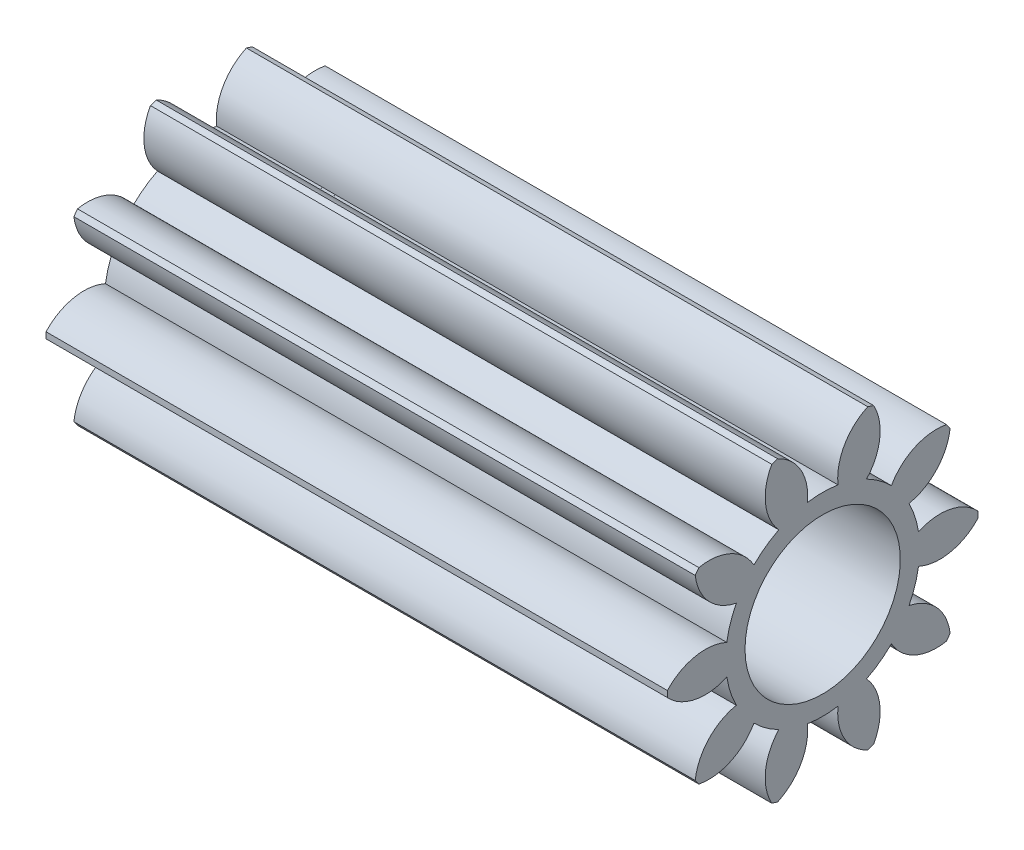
ISO-10303-21;
HEADER;
FILE_DESCRIPTION(('STEP AP214'),'2;1');
FILE_NAME('part.step','',(''),(''),'','','');
FILE_SCHEMA(('AUTOMOTIVE_DESIGN { 1 0 10303 214 1 1 1 1 }'));
ENDSEC;
DATA;
#1=APPLICATION_CONTEXT('core data for automotive mechanical design processes');
#2=APPLICATION_PROTOCOL_DEFINITION('international standard','automotive_design',2000,#1);
#3=PRODUCT_CONTEXT('',#1,'mechanical');
#4=PRODUCT('Part','Part','',(#3));
#5=PRODUCT_RELATED_PRODUCT_CATEGORY('part','',(#4));
#6=PRODUCT_DEFINITION_FORMATION('','',#4);
#7=PRODUCT_DEFINITION_CONTEXT('part definition',#1,'design');
#8=PRODUCT_DEFINITION('design','',#6,#7);
#9=PRODUCT_DEFINITION_SHAPE('','',#8);
#10=(LENGTH_UNIT() NAMED_UNIT(*) SI_UNIT(.MILLI.,.METRE.));
#11=(NAMED_UNIT(*) PLANE_ANGLE_UNIT() SI_UNIT($,.RADIAN.));
#12=(NAMED_UNIT(*) SI_UNIT($,.STERADIAN.) SOLID_ANGLE_UNIT());
#13=UNCERTAINTY_MEASURE_WITH_UNIT(LENGTH_MEASURE(1.E-05),#10,'distance_accuracy_value','');
#14=(GEOMETRIC_REPRESENTATION_CONTEXT(3) GLOBAL_UNCERTAINTY_ASSIGNED_CONTEXT((#13)) GLOBAL_UNIT_ASSIGNED_CONTEXT((#10,
#11,#12)) REPRESENTATION_CONTEXT('',''));
#15=CARTESIAN_POINT('',(0.,0.,0.));
#16=DIRECTION('',(0.,0.,1.));
#17=DIRECTION('',(1.,0.,0.));
#18=AXIS2_PLACEMENT_3D('',#15,#16,#17);
#19=CARTESIAN_POINT('',(12.,0.,0.));
#20=DIRECTION('',(-1.,0.,0.));
#21=DIRECTION('',(0.,0.,1.));
#22=AXIS2_PLACEMENT_3D('',#19,#20,#21);
#23=PLANE('',#22);
#24=CARTESIAN_POINT('',(12.,0.,0.));
#25=DIRECTION('',(-1.,0.,0.));
#26=DIRECTION('',(0.,0.,1.));
#27=AXIS2_PLACEMENT_3D('',#24,#25,#26);
#28=CIRCLE('',#27,1.5);
#29=CARTESIAN_POINT('',(12.,0.,1.5));
#30=VERTEX_POINT('',#29);
#31=EDGE_CURVE('E352',#30,#30,#28,.F.);
#32=ORIENTED_EDGE('',*,*,#31,.F.);
#33=EDGE_LOOP('',(#32));
#34=FACE_BOUND('',#33,.T.);
#35=CARTESIAN_POINT('',(12.,-0.620212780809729,-2.26588282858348));
#36=DIRECTION('',(-1.,0.,0.));
#37=DIRECTION('',(0.,-0.95105651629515,-0.309016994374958));
#38=AXIS2_PLACEMENT_3D('',#35,#36,#37);
#39=CIRCLE('',#38,1.);
#40=CARTESIAN_POINT('',(12.,0.289865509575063,-1.85144645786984));
#41=VERTEX_POINT('',#40);
#42=CARTESIAN_POINT('',(12.,0.0594463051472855,-2.99941096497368));
#43=VERTEX_POINT('',#42);
#44=EDGE_CURVE('E358',#41,#43,#39,.T.);
#45=ORIENTED_EDGE('',*,*,#44,.F.);
#46=CARTESIAN_POINT('',(12.,0.,0.));
#47=DIRECTION('',(-1.,0.,0.));
#48=DIRECTION('',(0.,-0.95105651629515,-0.309016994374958));
#49=AXIS2_PLACEMENT_3D('',#46,#47,#48);
#50=CIRCLE('',#49,1.874);
#51=CARTESIAN_POINT('',(12.,0.853746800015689,-1.66823032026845));
#52=VERTEX_POINT('',#51);
#53=EDGE_CURVE('E363',#52,#41,#50,.T.);
#54=ORIENTED_EDGE('',*,*,#53,.F.);
#55=CARTESIAN_POINT('',(12.,1.83361518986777,-1.46858578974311));
#56=DIRECTION('',(-1.,0.,0.));
#57=DIRECTION('',(0.,-0.95105651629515,-0.309016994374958));
#58=AXIS2_PLACEMENT_3D('',#55,#56,#57);
#59=CIRCLE('',#58,1.);
#60=CARTESIAN_POINT('',(12.,1.71491645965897,-2.46151610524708));
#61=VERTEX_POINT('',#60);
#62=EDGE_CURVE('E360',#61,#52,#59,.T.);
#63=ORIENTED_EDGE('',*,*,#62,.F.);
#64=CARTESIAN_POINT('',(12.,0.,0.));
#65=DIRECTION('',(-1.,0.,0.));
#66=DIRECTION('',(0.,0.,1.));
#67=AXIS2_PLACEMENT_3D('',#64,#65,#66);
#68=CIRCLE('',#67,3.);
#69=CARTESIAN_POINT('',(12.,1.81110260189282,-2.39163278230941));
#70=VERTEX_POINT('',#69);
#71=EDGE_CURVE('E524',#70,#61,#68,.T.);
#72=ORIENTED_EDGE('',*,*,#71,.F.);
#73=CARTESIAN_POINT('',(12.,0.830089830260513,-2.19768964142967));
#74=DIRECTION('',(-1.,0.,0.));
#75=DIRECTION('',(0.,-0.587785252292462,-0.809016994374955));
#76=AXIS2_PLACEMENT_3D('',#73,#74,#75);
#77=CIRCLE('',#76,1.);
#78=CARTESIAN_POINT('',(12.,1.32275904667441,-1.32747297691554));
#79=VERTEX_POINT('',#78);
#80=EDGE_CURVE('E343',#79,#70,#77,.T.);
#81=ORIENTED_EDGE('',*,*,#80,.F.);
#82=CARTESIAN_POINT('',(12.,0.,0.));
#83=DIRECTION('',(-1.,0.,0.));
#84=DIRECTION('',(0.,-0.587785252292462,-0.809016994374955));
#85=AXIS2_PLACEMENT_3D('',#82,#83,#84);
#86=CIRCLE('',#85,1.874);
#87=CARTESIAN_POINT('',(12.,1.67125684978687,-0.84780690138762));
#88=VERTEX_POINT('',#87);
#89=EDGE_CURVE('E348',#88,#79,#86,.T.);
#90=ORIENTED_EDGE('',*,*,#89,.F.);
#91=CARTESIAN_POINT('',(12.,2.34663891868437,-0.110338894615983));
#92=DIRECTION('',(-1.,0.,0.));
#93=DIRECTION('',(0.,-0.587785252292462,-0.809016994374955));
#94=AXIS2_PLACEMENT_3D('',#91,#92,#93);
#95=CIRCLE('',#94,1.);
#96=CARTESIAN_POINT('',(12.,2.83423942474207,-0.983405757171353));
#97=VERTEX_POINT('',#96);
#98=EDGE_CURVE('E345',#97,#88,#95,.T.);
#99=ORIENTED_EDGE('',*,*,#98,.F.);
#100=CARTESIAN_POINT('',(12.,2.87097926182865,-0.870332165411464));
#101=VERTEX_POINT('',#100);
#102=EDGE_CURVE('E520',#101,#97,#68,.T.);
#103=ORIENTED_EDGE('',*,*,#102,.F.);
#104=CARTESIAN_POINT('',(12.,1.96332633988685,-1.29005370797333));
#105=DIRECTION('',(-1.,0.,0.));
#106=DIRECTION('',(0.,0.,-1.));
#107=AXIS2_PLACEMENT_3D('',#104,#105,#106);
#108=CIRCLE('',#107,1.);
#109=CARTESIAN_POINT('',(12.,1.85040358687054,-0.296449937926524));
#110=VERTEX_POINT('',#109);
#111=EDGE_CURVE('E492',#110,#101,#108,.T.);
#112=ORIENTED_EDGE('',*,*,#111,.F.);
#113=CARTESIAN_POINT('',(12.,0.,0.));
#114=DIRECTION('',(-1.,0.,0.));
#115=DIRECTION('',(0.,0.,-1.));
#116=AXIS2_PLACEMENT_3D('',#113,#114,#115);
#117=CIRCLE('',#116,1.874);
#118=CARTESIAN_POINT('',(12.,1.85040358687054,0.296449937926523));
#119=VERTEX_POINT('',#118);
#120=EDGE_CURVE('E497',#119,#110,#117,.T.);
#121=ORIENTED_EDGE('',*,*,#120,.F.);
#122=CARTESIAN_POINT('',(12.,1.96332633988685,1.29005370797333));
#123=DIRECTION('',(-1.,0.,0.));
#124=DIRECTION('',(0.,0.,-1.));
#125=AXIS2_PLACEMENT_3D('',#122,#123,#124);
#126=CIRCLE('',#125,1.);
#127=CARTESIAN_POINT('',(12.,2.87097926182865,0.870332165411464));
#128=VERTEX_POINT('',#127);
#129=EDGE_CURVE('E494',#128,#119,#126,.T.);
#130=ORIENTED_EDGE('',*,*,#129,.F.);
#131=CARTESIAN_POINT('',(12.,2.83423942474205,0.983405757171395));
#132=VERTEX_POINT('',#131);
#133=EDGE_CURVE('E517',#132,#128,#68,.T.);
#134=ORIENTED_EDGE('',*,*,#133,.F.);
#135=CARTESIAN_POINT('',(12.,2.34663891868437,0.110338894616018));
#136=DIRECTION('',(-1.,0.,0.));
#137=DIRECTION('',(0.,0.587785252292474,-0.809016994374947));
#138=AXIS2_PLACEMENT_3D('',#135,#136,#137);
#139=CIRCLE('',#138,1.);
#140=CARTESIAN_POINT('',(12.,1.67125684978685,0.847806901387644));
#141=VERTEX_POINT('',#140);
#142=EDGE_CURVE('E470',#141,#132,#139,.T.);
#143=ORIENTED_EDGE('',*,*,#142,.F.);
#144=CARTESIAN_POINT('',(12.,0.,0.));
#145=DIRECTION('',(-1.,0.,0.));
#146=DIRECTION('',(0.,0.587785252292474,-0.809016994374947));
#147=AXIS2_PLACEMENT_3D('',#144,#145,#146);
#148=CIRCLE('',#147,1.874);
#149=CARTESIAN_POINT('',(12.,1.32275904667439,1.32747297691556));
#150=VERTEX_POINT('',#149);
#151=EDGE_CURVE('E475',#150,#141,#148,.T.);
#152=ORIENTED_EDGE('',*,*,#151,.F.);
#153=CARTESIAN_POINT('',(12.,0.830089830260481,2.19768964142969));
#154=DIRECTION('',(-1.,0.,0.));
#155=DIRECTION('',(0.,0.587785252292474,-0.809016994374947));
#156=AXIS2_PLACEMENT_3D('',#153,#154,#155);
#157=CIRCLE('',#156,1.);
#158=CARTESIAN_POINT('',(12.,1.81110260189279,2.39163278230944));
#159=VERTEX_POINT('',#158);
#160=EDGE_CURVE('E472',#159,#150,#157,.T.);
#161=ORIENTED_EDGE('',*,*,#160,.F.);
#162=CARTESIAN_POINT('',(12.,1.71491645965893,2.4615161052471));
#163=VERTEX_POINT('',#162);
#164=EDGE_CURVE('E525',#163,#159,#68,.T.);
#165=ORIENTED_EDGE('',*,*,#164,.F.);
#166=CARTESIAN_POINT('',(12.,1.83361518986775,1.46858578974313));
#167=DIRECTION('',(-1.,0.,0.));
#168=DIRECTION('',(0.,0.951056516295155,-0.309016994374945));
#169=AXIS2_PLACEMENT_3D('',#166,#167,#168);
#170=CIRCLE('',#169,1.);
#171=CARTESIAN_POINT('',(12.,0.853746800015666,1.66823032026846));
#172=VERTEX_POINT('',#171);
#173=EDGE_CURVE('E405',#172,#163,#170,.T.);
#174=ORIENTED_EDGE('',*,*,#173,.F.);
#175=CARTESIAN_POINT('',(12.,0.,0.));
#176=DIRECTION('',(-1.,0.,0.));
#177=DIRECTION('',(0.,0.951056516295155,-0.309016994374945));
#178=AXIS2_PLACEMENT_3D('',#175,#176,#177);
#179=CIRCLE('',#178,1.874);
#180=CARTESIAN_POINT('',(12.,0.289865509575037,1.85144645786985));
#181=VERTEX_POINT('',#180);
#182=EDGE_CURVE('E410',#181,#172,#179,.T.);
#183=ORIENTED_EDGE('',*,*,#182,.F.);
#184=CARTESIAN_POINT('',(12.,-0.620212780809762,2.26588282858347));
#185=DIRECTION('',(-1.,0.,0.));
#186=DIRECTION('',(0.,0.951056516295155,-0.309016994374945));
#187=AXIS2_PLACEMENT_3D('',#184,#185,#186);
#188=CIRCLE('',#187,1.);
#189=CARTESIAN_POINT('',(12.,0.0594463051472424,2.99941096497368));
#190=VERTEX_POINT('',#189);
#191=EDGE_CURVE('E407',#190,#181,#188,.T.);
#192=ORIENTED_EDGE('',*,*,#191,.F.);
#193=CARTESIAN_POINT('',(12.,-0.0594463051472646,2.99941096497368));
#194=VERTEX_POINT('',#193);
#195=EDGE_CURVE('E688',#194,#190,#68,.T.);
#196=ORIENTED_EDGE('',*,*,#195,.F.);
#197=CARTESIAN_POINT('',(12.,0.620212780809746,2.26588282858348));
#198=DIRECTION('',(-1.,0.,0.));
#199=DIRECTION('',(0.,0.951056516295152,0.309016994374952));
#200=AXIS2_PLACEMENT_3D('',#197,#198,#199);
#201=CIRCLE('',#200,1.);
#202=CARTESIAN_POINT('',(12.,-0.28986550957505,1.85144645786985));
#203=VERTEX_POINT('',#202);
#204=EDGE_CURVE('E424',#203,#194,#201,.T.);
#205=ORIENTED_EDGE('',*,*,#204,.F.);
#206=CARTESIAN_POINT('',(12.,0.,0.));
#207=DIRECTION('',(-1.,0.,0.));
#208=DIRECTION('',(0.,0.951056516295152,0.309016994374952));
#209=AXIS2_PLACEMENT_3D('',#206,#207,#208);
#210=CIRCLE('',#209,1.874);
#211=CARTESIAN_POINT('',(12.,-0.853746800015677,1.66823032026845));
#212=VERTEX_POINT('',#211);
#213=EDGE_CURVE('E429',#212,#203,#210,.T.);
#214=ORIENTED_EDGE('',*,*,#213,.F.);
#215=CARTESIAN_POINT('',(12.,-1.83361518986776,1.46858578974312));
#216=DIRECTION('',(-1.,0.,0.));
#217=DIRECTION('',(0.,0.951056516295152,0.309016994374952));
#218=AXIS2_PLACEMENT_3D('',#215,#216,#217);
#219=CIRCLE('',#218,1.);
#220=CARTESIAN_POINT('',(12.,-1.71491645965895,2.46151610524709));
#221=VERTEX_POINT('',#220);
#222=EDGE_CURVE('E426',#221,#212,#219,.T.);
#223=ORIENTED_EDGE('',*,*,#222,.F.);
#224=CARTESIAN_POINT('',(12.,-1.8111026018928,2.39163278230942));
#225=VERTEX_POINT('',#224);
#226=EDGE_CURVE('E669',#225,#221,#68,.T.);
#227=ORIENTED_EDGE('',*,*,#226,.F.);
#228=CARTESIAN_POINT('',(12.,-0.830089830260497,2.19768964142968));
#229=DIRECTION('',(-1.,0.,0.));
#230=DIRECTION('',(0.,0.587785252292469,0.809016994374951));
#231=AXIS2_PLACEMENT_3D('',#228,#229,#230);
#232=CIRCLE('',#231,1.);
#233=CARTESIAN_POINT('',(12.,-1.3227590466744,1.32747297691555));
#234=VERTEX_POINT('',#233);
#235=EDGE_CURVE('E388',#234,#225,#232,.T.);
#236=ORIENTED_EDGE('',*,*,#235,.F.);
#237=CARTESIAN_POINT('',(12.,0.,0.));
#238=DIRECTION('',(-1.,0.,0.));
#239=DIRECTION('',(0.,0.587785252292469,0.809016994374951));
#240=AXIS2_PLACEMENT_3D('',#237,#238,#239);
#241=CIRCLE('',#240,1.874);
#242=CARTESIAN_POINT('',(12.,-1.67125684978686,0.847806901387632));
#243=VERTEX_POINT('',#242);
#244=EDGE_CURVE('E393',#243,#234,#241,.T.);
#245=ORIENTED_EDGE('',*,*,#244,.F.);
#246=CARTESIAN_POINT('',(12.,-2.34663891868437,0.110338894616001));
#247=DIRECTION('',(-1.,0.,0.));
#248=DIRECTION('',(0.,0.587785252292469,0.809016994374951));
#249=AXIS2_PLACEMENT_3D('',#246,#247,#248);
#250=CIRCLE('',#249,1.);
#251=CARTESIAN_POINT('',(12.,-2.83423942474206,0.983405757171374));
#252=VERTEX_POINT('',#251);
#253=EDGE_CURVE('E390',#252,#243,#250,.T.);
#254=ORIENTED_EDGE('',*,*,#253,.F.);
#255=CARTESIAN_POINT('',(12.,-2.87097926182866,0.870332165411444));
#256=VERTEX_POINT('',#255);
#257=EDGE_CURVE('E650',#256,#252,#68,.T.);
#258=ORIENTED_EDGE('',*,*,#257,.F.);
#259=CARTESIAN_POINT('',(12.,-1.96332633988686,1.29005370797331));
#260=DIRECTION('',(-1.,0.,0.));
#261=DIRECTION('',(0.,0.,1.));
#262=AXIS2_PLACEMENT_3D('',#259,#260,#261);
#263=CIRCLE('',#262,1.);
#264=CARTESIAN_POINT('',(12.,-1.85040358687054,0.296449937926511));
#265=VERTEX_POINT('',#264);
#266=EDGE_CURVE('E371',#265,#256,#263,.T.);
#267=ORIENTED_EDGE('',*,*,#266,.F.);
#268=CARTESIAN_POINT('',(12.,0.,0.));
#269=DIRECTION('',(-1.,0.,0.));
#270=DIRECTION('',(0.,0.,1.));
#271=AXIS2_PLACEMENT_3D('',#268,#269,#270);
#272=CIRCLE('',#271,1.874);
#273=CARTESIAN_POINT('',(12.,-1.85040358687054,-0.296449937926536));
#274=VERTEX_POINT('',#273);
#275=EDGE_CURVE('E376',#274,#265,#272,.T.);
#276=ORIENTED_EDGE('',*,*,#275,.F.);
#277=CARTESIAN_POINT('',(12.,-1.96332633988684,-1.29005370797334));
#278=DIRECTION('',(-1.,0.,0.));
#279=DIRECTION('',(0.,0.,1.));
#280=AXIS2_PLACEMENT_3D('',#277,#278,#279);
#281=CIRCLE('',#280,1.);
#282=CARTESIAN_POINT('',(12.,-2.87097926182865,-0.870332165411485));
#283=VERTEX_POINT('',#282);
#284=EDGE_CURVE('E373',#283,#274,#281,.T.);
#285=ORIENTED_EDGE('',*,*,#284,.F.);
#286=CARTESIAN_POINT('',(12.,-2.83423942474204,-0.983405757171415));
#287=VERTEX_POINT('',#286);
#288=EDGE_CURVE('E631',#287,#283,#68,.T.);
#289=ORIENTED_EDGE('',*,*,#288,.F.);
#290=CARTESIAN_POINT('',(12.,-2.34663891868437,-0.110338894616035));
#291=DIRECTION('',(-1.,0.,0.));
#292=DIRECTION('',(0.,-0.58778525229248,0.809016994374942));
#293=AXIS2_PLACEMENT_3D('',#290,#291,#292);
#294=CIRCLE('',#293,1.);
#295=CARTESIAN_POINT('',(12.,-1.67125684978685,-0.847806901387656));
#296=VERTEX_POINT('',#295);
#297=EDGE_CURVE('E326',#296,#287,#294,.T.);
#298=ORIENTED_EDGE('',*,*,#297,.F.);
#299=CARTESIAN_POINT('',(12.,0.,0.));
#300=DIRECTION('',(-1.,0.,0.));
#301=DIRECTION('',(0.,-0.58778525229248,0.809016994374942));
#302=AXIS2_PLACEMENT_3D('',#299,#300,#301);
#303=CIRCLE('',#302,1.874);
#304=CARTESIAN_POINT('',(12.,-1.32275904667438,-1.32747297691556));
#305=VERTEX_POINT('',#304);
#306=EDGE_CURVE('E331',#305,#296,#303,.T.);
#307=ORIENTED_EDGE('',*,*,#306,.F.);
#308=CARTESIAN_POINT('',(12.,-0.830089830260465,-2.19768964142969));
#309=DIRECTION('',(-1.,0.,0.));
#310=DIRECTION('',(0.,-0.58778525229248,0.809016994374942));
#311=AXIS2_PLACEMENT_3D('',#308,#309,#310);
#312=CIRCLE('',#311,1.);
#313=CARTESIAN_POINT('',(12.,-1.81110260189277,-2.39163278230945));
#314=VERTEX_POINT('',#313);
#315=EDGE_CURVE('E328',#314,#305,#312,.T.);
#316=ORIENTED_EDGE('',*,*,#315,.F.);
#317=CARTESIAN_POINT('',(12.,-1.71491645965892,-2.46151610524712));
#318=VERTEX_POINT('',#317);
#319=EDGE_CURVE('E612',#318,#314,#68,.T.);
#320=ORIENTED_EDGE('',*,*,#319,.F.);
#321=CARTESIAN_POINT('',(12.,-1.83361518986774,-1.46858578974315));
#322=DIRECTION('',(-1.,0.,0.));
#323=DIRECTION('',(0.,-0.951056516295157,0.309016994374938));
#324=AXIS2_PLACEMENT_3D('',#321,#322,#323);
#325=CIRCLE('',#324,1.);
#326=CARTESIAN_POINT('',(12.,-0.853746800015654,-1.66823032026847));
#327=VERTEX_POINT('',#326);
#328=EDGE_CURVE('E302',#327,#318,#325,.T.);
#329=ORIENTED_EDGE('',*,*,#328,.F.);
#330=CARTESIAN_POINT('',(12.,0.,0.));
#331=DIRECTION('',(-1.,0.,0.));
#332=DIRECTION('',(0.,-0.951056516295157,0.309016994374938));
#333=AXIS2_PLACEMENT_3D('',#330,#331,#332);
#334=CIRCLE('',#333,1.874);
#335=CARTESIAN_POINT('',(12.,-0.289865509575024,-1.85144645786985));
#336=VERTEX_POINT('',#335);
#337=EDGE_CURVE('E301',#336,#327,#334,.T.);
#338=ORIENTED_EDGE('',*,*,#337,.F.);
#339=CARTESIAN_POINT('',(12.,0.620212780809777,-2.26588282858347));
#340=DIRECTION('',(-1.,0.,0.));
#341=DIRECTION('',(0.,-0.951056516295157,0.309016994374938));
#342=AXIS2_PLACEMENT_3D('',#339,#340,#341);
#343=CIRCLE('',#342,1.);
#344=CARTESIAN_POINT('',(12.,-0.0594463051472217,-2.99941096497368));
#345=VERTEX_POINT('',#344);
#346=EDGE_CURVE('E290',#345,#336,#343,.T.);
#347=ORIENTED_EDGE('',*,*,#346,.F.);
#348=EDGE_CURVE('E748',#43,#345,#68,.T.);
#349=ORIENTED_EDGE('',*,*,#348,.F.);
#350=EDGE_LOOP('',(#45,#54,#63,#72,#81,#90,#99,#103,#112,#121,#130,#134,#143,#152,#161,#165,
#174,#183,#192,#196,#205,#214,#223,#227,#236,#245,#254,#258,#267,#276,#285,#289,#298,#307,#316,
#320,#329,#338,#347,#349));
#351=FACE_BOUND('',#350,.T.);
#352=ADVANCED_FACE('F33',(#34,#351),#23,.F.);
#353=CARTESIAN_POINT('',(-10.,0.,0.));
#354=DIRECTION('',(-1.,0.,0.));
#355=DIRECTION('',(0.,0.,1.));
#356=AXIS2_PLACEMENT_3D('',#353,#354,#355);
#357=CYLINDRICAL_SURFACE('',#356,3.);
#358=DIRECTION('',(-1.,0.,0.));
#359=VECTOR('',#358,1.);
#360=CARTESIAN_POINT('',(6.,0.0594463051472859,-2.99941096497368));
#361=LINE('',#360,#359);
#362=CARTESIAN_POINT('',(0.,0.0594463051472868,-2.99941096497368));
#363=VERTEX_POINT('',#362);
#364=EDGE_CURVE('E467',#43,#363,#361,.T.);
#365=ORIENTED_EDGE('',*,*,#364,.F.);
#366=ORIENTED_EDGE('',*,*,#348,.T.);
#367=DIRECTION('',(-1.,0.,0.));
#368=VECTOR('',#367,1.);
#369=CARTESIAN_POINT('',(6.,-0.0594463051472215,-2.99941096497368));
#370=LINE('',#369,#368);
#371=CARTESIAN_POINT('',(0.,-0.0594463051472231,-2.99941096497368));
#372=VERTEX_POINT('',#371);
#373=EDGE_CURVE('E296',#372,#345,#370,.F.);
#374=ORIENTED_EDGE('',*,*,#373,.F.);
#375=CARTESIAN_POINT('',(0.,0.,0.));
#376=DIRECTION('',(-1.,0.,0.));
#377=DIRECTION('',(0.,0.,1.));
#378=AXIS2_PLACEMENT_3D('',#375,#376,#377);
#379=CIRCLE('',#378,3.);
#380=EDGE_CURVE('E582',#363,#372,#379,.T.);
#381=ORIENTED_EDGE('',*,*,#380,.F.);
#382=EDGE_LOOP('',(#365,#366,#374,#381));
#383=FACE_BOUND('',#382,.T.);
#384=ADVANCED_FACE('F733',(#383),#357,.T.);
#385=DIRECTION('',(-1.,0.,0.));
#386=VECTOR('',#385,1.);
#387=CARTESIAN_POINT('',(6.,1.71491645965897,-2.46151610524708));
#388=LINE('',#387,#386);
#389=CARTESIAN_POINT('',(0.,1.71491645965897,-2.46151610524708));
#390=VERTEX_POINT('',#389);
#391=EDGE_CURVE('E465',#390,#61,#388,.F.);
#392=ORIENTED_EDGE('',*,*,#391,.F.);
#393=CARTESIAN_POINT('',(0.,1.81110260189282,-2.39163278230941));
#394=VERTEX_POINT('',#393);
#395=EDGE_CURVE('E518',#394,#390,#379,.T.);
#396=ORIENTED_EDGE('',*,*,#395,.F.);
#397=DIRECTION('',(-1.,0.,0.));
#398=VECTOR('',#397,1.);
#399=CARTESIAN_POINT('',(6.,1.81110260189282,-2.39163278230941));
#400=LINE('',#399,#398);
#401=EDGE_CURVE('E463',#70,#394,#400,.T.);
#402=ORIENTED_EDGE('',*,*,#401,.F.);
#403=ORIENTED_EDGE('',*,*,#71,.T.);
#404=EDGE_LOOP('',(#392,#396,#402,#403));
#405=FACE_BOUND('',#404,.T.);
#406=ADVANCED_FACE('F579',(#405),#357,.T.);
#407=DIRECTION('',(-1.,0.,0.));
#408=VECTOR('',#407,1.);
#409=CARTESIAN_POINT('',(6.,2.83423942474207,-0.983405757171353));
#410=LINE('',#409,#408);
#411=CARTESIAN_POINT('',(0.,2.83423942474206,-0.983405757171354));
#412=VERTEX_POINT('',#411);
#413=EDGE_CURVE('E461',#412,#97,#410,.F.);
#414=ORIENTED_EDGE('',*,*,#413,.F.);
#415=CARTESIAN_POINT('',(0.,2.87097926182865,-0.870332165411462));
#416=VERTEX_POINT('',#415);
#417=EDGE_CURVE('E514',#416,#412,#379,.T.);
#418=ORIENTED_EDGE('',*,*,#417,.F.);
#419=DIRECTION('',(-1.,0.,0.));
#420=VECTOR('',#419,1.);
#421=CARTESIAN_POINT('',(6.,2.87097926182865,-0.870332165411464));
#422=LINE('',#421,#420);
#423=EDGE_CURVE('E511',#101,#416,#422,.T.);
#424=ORIENTED_EDGE('',*,*,#423,.F.);
#425=ORIENTED_EDGE('',*,*,#102,.T.);
#426=EDGE_LOOP('',(#414,#418,#424,#425));
#427=FACE_BOUND('',#426,.T.);
#428=ADVANCED_FACE('F553',(#427),#357,.T.);
#429=DIRECTION('',(-1.,0.,0.));
#430=VECTOR('',#429,1.);
#431=CARTESIAN_POINT('',(6.,-2.83423942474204,-0.983405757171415));
#432=LINE('',#431,#430);
#433=CARTESIAN_POINT('',(0.,-2.83423942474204,-0.983405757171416));
#434=VERTEX_POINT('',#433);
#435=EDGE_CURVE('E459',#287,#434,#432,.T.);
#436=ORIENTED_EDGE('',*,*,#435,.F.);
#437=ORIENTED_EDGE('',*,*,#288,.T.);
#438=DIRECTION('',(-1.,0.,0.));
#439=VECTOR('',#438,1.);
#440=CARTESIAN_POINT('',(6.,-2.87097926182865,-0.870332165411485));
#441=LINE('',#440,#439);
#442=CARTESIAN_POINT('',(0.,-2.87097926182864,-0.870332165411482));
#443=VERTEX_POINT('',#442);
#444=EDGE_CURVE('E442',#443,#283,#441,.F.);
#445=ORIENTED_EDGE('',*,*,#444,.F.);
#446=EDGE_CURVE('E598',#434,#443,#379,.T.);
#447=ORIENTED_EDGE('',*,*,#446,.F.);
#448=EDGE_LOOP('',(#436,#437,#445,#447));
#449=FACE_BOUND('',#448,.T.);
#450=ADVANCED_FACE('F629',(#449),#357,.T.);
#451=DIRECTION('',(-1.,0.,0.));
#452=VECTOR('',#451,1.);
#453=CARTESIAN_POINT('',(6.,-1.81110260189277,-2.39163278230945));
#454=LINE('',#453,#452);
#455=CARTESIAN_POINT('',(0.,-1.81110260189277,-2.39163278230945));
#456=VERTEX_POINT('',#455);
#457=EDGE_CURVE('E457',#456,#314,#454,.F.);
#458=ORIENTED_EDGE('',*,*,#457,.F.);
#459=CARTESIAN_POINT('',(0.,-1.71491645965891,-2.46151610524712));
#460=VERTEX_POINT('',#459);
#461=EDGE_CURVE('E584',#460,#456,#379,.T.);
#462=ORIENTED_EDGE('',*,*,#461,.F.);
#463=DIRECTION('',(-1.,0.,0.));
#464=VECTOR('',#463,1.);
#465=CARTESIAN_POINT('',(6.,-1.71491645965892,-2.46151610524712));
#466=LINE('',#465,#464);
#467=EDGE_CURVE('E455',#318,#460,#466,.T.);
#468=ORIENTED_EDGE('',*,*,#467,.F.);
#469=ORIENTED_EDGE('',*,*,#319,.T.);
#470=EDGE_LOOP('',(#458,#462,#468,#469));
#471=FACE_BOUND('',#470,.T.);
#472=ADVANCED_FACE('F610',(#471),#357,.T.);
#473=DIRECTION('',(-1.,0.,0.));
#474=VECTOR('',#473,1.);
#475=CARTESIAN_POINT('',(6.,1.71491645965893,2.4615161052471));
#476=LINE('',#475,#474);
#477=CARTESIAN_POINT('',(0.,1.71491645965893,2.4615161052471));
#478=VERTEX_POINT('',#477);
#479=EDGE_CURVE('E452',#163,#478,#476,.T.);
#480=ORIENTED_EDGE('',*,*,#479,.F.);
#481=ORIENTED_EDGE('',*,*,#164,.T.);
#482=DIRECTION('',(-1.,0.,0.));
#483=VECTOR('',#482,1.);
#484=CARTESIAN_POINT('',(6.,1.81110260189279,2.39163278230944));
#485=LINE('',#484,#483);
#486=CARTESIAN_POINT('',(0.,1.81110260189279,2.39163278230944));
#487=VERTEX_POINT('',#486);
#488=EDGE_CURVE('E486',#487,#159,#485,.F.);
#489=ORIENTED_EDGE('',*,*,#488,.F.);
#490=EDGE_CURVE('E519',#478,#487,#379,.T.);
#491=ORIENTED_EDGE('',*,*,#490,.F.);
#492=EDGE_LOOP('',(#480,#481,#489,#491));
#493=FACE_BOUND('',#492,.T.);
#494=ADVANCED_FACE('F705',(#493),#357,.T.);
#495=DIRECTION('',(-1.,0.,0.));
#496=VECTOR('',#495,1.);
#497=CARTESIAN_POINT('',(6.,0.0594463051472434,2.99941096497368));
#498=LINE('',#497,#496);
#499=CARTESIAN_POINT('',(0.,0.0594463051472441,2.99941096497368));
#500=VERTEX_POINT('',#499);
#501=EDGE_CURVE('E450',#500,#190,#498,.F.);
#502=ORIENTED_EDGE('',*,*,#501,.F.);
#503=CARTESIAN_POINT('',(0.,-0.0594463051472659,2.99941096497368));
#504=VERTEX_POINT('',#503);
#505=EDGE_CURVE('E586',#504,#500,#379,.T.);
#506=ORIENTED_EDGE('',*,*,#505,.F.);
#507=DIRECTION('',(-1.,0.,0.));
#508=VECTOR('',#507,1.);
#509=CARTESIAN_POINT('',(6.,-0.0594463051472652,2.99941096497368));
#510=LINE('',#509,#508);
#511=EDGE_CURVE('E448',#194,#504,#510,.T.);
#512=ORIENTED_EDGE('',*,*,#511,.F.);
#513=ORIENTED_EDGE('',*,*,#195,.T.);
#514=EDGE_LOOP('',(#502,#506,#512,#513));
#515=FACE_BOUND('',#514,.T.);
#516=ADVANCED_FACE('F686',(#515),#357,.T.);
#517=DIRECTION('',(-1.,0.,0.));
#518=VECTOR('',#517,1.);
#519=CARTESIAN_POINT('',(6.,-1.71491645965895,2.46151610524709));
#520=LINE('',#519,#518);
#521=CARTESIAN_POINT('',(0.,-1.71491645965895,2.46151610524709));
#522=VERTEX_POINT('',#521);
#523=EDGE_CURVE('E446',#522,#221,#520,.F.);
#524=ORIENTED_EDGE('',*,*,#523,.F.);
#525=CARTESIAN_POINT('',(0.,-1.8111026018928,2.39163278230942));
#526=VERTEX_POINT('',#525);
#527=EDGE_CURVE('E590',#526,#522,#379,.T.);
#528=ORIENTED_EDGE('',*,*,#527,.F.);
#529=DIRECTION('',(-1.,0.,0.));
#530=VECTOR('',#529,1.);
#531=CARTESIAN_POINT('',(6.,-1.8111026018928,2.39163278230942));
#532=LINE('',#531,#530);
#533=EDGE_CURVE('E440',#225,#526,#532,.T.);
#534=ORIENTED_EDGE('',*,*,#533,.F.);
#535=ORIENTED_EDGE('',*,*,#226,.T.);
#536=EDGE_LOOP('',(#524,#528,#534,#535));
#537=FACE_BOUND('',#536,.T.);
#538=ADVANCED_FACE('F667',(#537),#357,.T.);
#539=DIRECTION('',(-1.,0.,0.));
#540=VECTOR('',#539,1.);
#541=CARTESIAN_POINT('',(6.,-2.87097926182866,0.870332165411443));
#542=LINE('',#541,#540);
#543=CARTESIAN_POINT('',(0.,-2.87097926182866,0.870332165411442));
#544=VERTEX_POINT('',#543);
#545=EDGE_CURVE('E444',#256,#544,#542,.T.);
#546=ORIENTED_EDGE('',*,*,#545,.F.);
#547=ORIENTED_EDGE('',*,*,#257,.T.);
#548=DIRECTION('',(-1.,0.,0.));
#549=VECTOR('',#548,1.);
#550=CARTESIAN_POINT('',(6.,-2.83423942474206,0.983405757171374));
#551=LINE('',#550,#549);
#552=CARTESIAN_POINT('',(0.,-2.83423942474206,0.983405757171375));
#553=VERTEX_POINT('',#552);
#554=EDGE_CURVE('E423',#553,#252,#551,.F.);
#555=ORIENTED_EDGE('',*,*,#554,.F.);
#556=EDGE_CURVE('E594',#544,#553,#379,.T.);
#557=ORIENTED_EDGE('',*,*,#556,.F.);
#558=EDGE_LOOP('',(#546,#547,#555,#557));
#559=FACE_BOUND('',#558,.T.);
#560=ADVANCED_FACE('F648',(#559),#357,.T.);
#561=CARTESIAN_POINT('',(0.,0.,0.));
#562=DIRECTION('',(1.,0.,0.));
#563=DIRECTION('',(0.,0.,-1.));
#564=AXIS2_PLACEMENT_3D('',#561,#562,#563);
#565=PLANE('',#564);
#566=CARTESIAN_POINT('',(0.,0.,0.));
#567=DIRECTION('',(1.,0.,0.));
#568=DIRECTION('',(0.,0.,-1.));
#569=AXIS2_PLACEMENT_3D('',#566,#567,#568);
#570=CIRCLE('',#569,1.5);
#571=CARTESIAN_POINT('',(0.,0.,-1.5));
#572=VERTEX_POINT('',#571);
#573=EDGE_CURVE('E36',#572,#572,#570,.F.);
#574=ORIENTED_EDGE('',*,*,#573,.F.);
#575=EDGE_LOOP('',(#574));
#576=FACE_BOUND('',#575,.T.);
#577=CARTESIAN_POINT('',(0.,-0.620212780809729,-2.26588282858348));
#578=DIRECTION('',(-1.,0.,0.));
#579=DIRECTION('',(0.,-0.95105651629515,-0.309016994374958));
#580=AXIS2_PLACEMENT_3D('',#577,#578,#579);
#581=CIRCLE('',#580,1.);
#582=CARTESIAN_POINT('',(0.,0.289865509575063,-1.85144645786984));
#583=VERTEX_POINT('',#582);
#584=EDGE_CURVE('E48',#583,#363,#581,.T.);
#585=ORIENTED_EDGE('',*,*,#584,.T.);
#586=ORIENTED_EDGE('',*,*,#380,.T.);
#587=CARTESIAN_POINT('',(0.,0.620212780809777,-2.26588282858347));
#588=DIRECTION('',(1.,0.,0.));
#589=DIRECTION('',(0.,0.,-1.));
#590=AXIS2_PLACEMENT_3D('',#587,#588,#589);
#591=CIRCLE('',#590,1.);
#592=CARTESIAN_POINT('',(0.,-0.289865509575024,-1.85144645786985));
#593=VERTEX_POINT('',#592);
#594=EDGE_CURVE('E539',#593,#372,#591,.T.);
#595=ORIENTED_EDGE('',*,*,#594,.F.);
#596=CARTESIAN_POINT('',(0.,0.,0.));
#597=DIRECTION('',(-1.,0.,0.));
#598=DIRECTION('',(0.,-0.951056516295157,0.309016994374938));
#599=AXIS2_PLACEMENT_3D('',#596,#597,#598);
#600=CIRCLE('',#599,1.874);
#601=CARTESIAN_POINT('',(0.,-0.853746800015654,-1.66823032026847));
#602=VERTEX_POINT('',#601);
#603=EDGE_CURVE('E309',#593,#602,#600,.T.);
#604=ORIENTED_EDGE('',*,*,#603,.T.);
#605=CARTESIAN_POINT('',(0.,-1.83361518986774,-1.46858578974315));
#606=DIRECTION('',(-1.,0.,0.));
#607=DIRECTION('',(0.,-0.951056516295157,0.309016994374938));
#608=AXIS2_PLACEMENT_3D('',#605,#606,#607);
#609=CIRCLE('',#608,1.);
#610=EDGE_CURVE('E321',#602,#460,#609,.T.);
#611=ORIENTED_EDGE('',*,*,#610,.T.);
#612=ORIENTED_EDGE('',*,*,#461,.T.);
#613=CARTESIAN_POINT('',(0.,-0.830089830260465,-2.19768964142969));
#614=DIRECTION('',(1.,0.,0.));
#615=DIRECTION('',(0.,0.,-1.));
#616=AXIS2_PLACEMENT_3D('',#613,#614,#615);
#617=CIRCLE('',#616,1.);
#618=CARTESIAN_POINT('',(0.,-1.32275904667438,-1.32747297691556));
#619=VERTEX_POINT('',#618);
#620=EDGE_CURVE('E541',#619,#456,#617,.T.);
#621=ORIENTED_EDGE('',*,*,#620,.F.);
#622=CARTESIAN_POINT('',(0.,0.,0.));
#623=DIRECTION('',(-1.,0.,0.));
#624=DIRECTION('',(0.,-0.58778525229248,0.809016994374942));
#625=AXIS2_PLACEMENT_3D('',#622,#623,#624);
#626=CIRCLE('',#625,1.874);
#627=CARTESIAN_POINT('',(0.,-1.67125684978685,-0.847806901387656));
#628=VERTEX_POINT('',#627);
#629=EDGE_CURVE('E329',#619,#628,#626,.T.);
#630=ORIENTED_EDGE('',*,*,#629,.T.);
#631=CARTESIAN_POINT('',(0.,-2.34663891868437,-0.110338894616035));
#632=DIRECTION('',(-1.,0.,0.));
#633=DIRECTION('',(0.,-0.58778525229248,0.809016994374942));
#634=AXIS2_PLACEMENT_3D('',#631,#632,#633);
#635=CIRCLE('',#634,1.);
#636=EDGE_CURVE('E311',#628,#434,#635,.T.);
#637=ORIENTED_EDGE('',*,*,#636,.T.);
#638=ORIENTED_EDGE('',*,*,#446,.T.);
#639=CARTESIAN_POINT('',(0.,-1.96332633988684,-1.29005370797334));
#640=DIRECTION('',(1.,0.,0.));
#641=DIRECTION('',(0.,0.,-1.));
#642=AXIS2_PLACEMENT_3D('',#639,#640,#641);
#643=CIRCLE('',#642,1.);
#644=CARTESIAN_POINT('',(0.,-1.85040358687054,-0.296449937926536));
#645=VERTEX_POINT('',#644);
#646=EDGE_CURVE('E533',#645,#443,#643,.T.);
#647=ORIENTED_EDGE('',*,*,#646,.F.);
#648=CARTESIAN_POINT('',(0.,0.,0.));
#649=DIRECTION('',(-1.,0.,0.));
#650=DIRECTION('',(0.,0.,1.));
#651=AXIS2_PLACEMENT_3D('',#648,#649,#650);
#652=CIRCLE('',#651,1.874);
#653=CARTESIAN_POINT('',(0.,-1.85040358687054,0.296449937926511));
#654=VERTEX_POINT('',#653);
#655=EDGE_CURVE('E374',#645,#654,#652,.T.);
#656=ORIENTED_EDGE('',*,*,#655,.T.);
#657=CARTESIAN_POINT('',(0.,-1.96332633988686,1.29005370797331));
#658=DIRECTION('',(-1.,0.,0.));
#659=DIRECTION('',(0.,0.,1.));
#660=AXIS2_PLACEMENT_3D('',#657,#658,#659);
#661=CIRCLE('',#660,1.);
#662=EDGE_CURVE('E342',#654,#544,#661,.T.);
#663=ORIENTED_EDGE('',*,*,#662,.T.);
#664=ORIENTED_EDGE('',*,*,#556,.T.);
#665=CARTESIAN_POINT('',(0.,-2.34663891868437,0.110338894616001));
#666=DIRECTION('',(1.,0.,0.));
#667=DIRECTION('',(0.,0.,-1.));
#668=AXIS2_PLACEMENT_3D('',#665,#666,#667);
#669=CIRCLE('',#668,1.);
#670=CARTESIAN_POINT('',(0.,-1.67125684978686,0.847806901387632));
#671=VERTEX_POINT('',#670);
#672=EDGE_CURVE('E531',#671,#553,#669,.T.);
#673=ORIENTED_EDGE('',*,*,#672,.F.);
#674=CARTESIAN_POINT('',(0.,0.,0.));
#675=DIRECTION('',(-1.,0.,0.));
#676=DIRECTION('',(0.,0.587785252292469,0.809016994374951));
#677=AXIS2_PLACEMENT_3D('',#674,#675,#676);
#678=CIRCLE('',#677,1.874);
#679=CARTESIAN_POINT('',(0.,-1.3227590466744,1.32747297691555));
#680=VERTEX_POINT('',#679);
#681=EDGE_CURVE('E391',#671,#680,#678,.T.);
#682=ORIENTED_EDGE('',*,*,#681,.T.);
#683=CARTESIAN_POINT('',(0.,-0.830089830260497,2.19768964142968));
#684=DIRECTION('',(-1.,0.,0.));
#685=DIRECTION('',(0.,0.587785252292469,0.809016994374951));
#686=AXIS2_PLACEMENT_3D('',#683,#684,#685);
#687=CIRCLE('',#686,1.);
#688=EDGE_CURVE('E387',#680,#526,#687,.T.);
#689=ORIENTED_EDGE('',*,*,#688,.T.);
#690=ORIENTED_EDGE('',*,*,#527,.T.);
#691=CARTESIAN_POINT('',(0.,-1.83361518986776,1.46858578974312));
#692=DIRECTION('',(1.,0.,0.));
#693=DIRECTION('',(0.,0.,-1.));
#694=AXIS2_PLACEMENT_3D('',#691,#692,#693);
#695=CIRCLE('',#694,1.);
#696=CARTESIAN_POINT('',(0.,-0.853746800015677,1.66823032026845));
#697=VERTEX_POINT('',#696);
#698=EDGE_CURVE('E535',#697,#522,#695,.T.);
#699=ORIENTED_EDGE('',*,*,#698,.F.);
#700=CARTESIAN_POINT('',(0.,0.,0.));
#701=DIRECTION('',(-1.,0.,0.));
#702=DIRECTION('',(0.,0.951056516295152,0.309016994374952));
#703=AXIS2_PLACEMENT_3D('',#700,#701,#702);
#704=CIRCLE('',#703,1.874);
#705=CARTESIAN_POINT('',(0.,-0.28986550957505,1.85144645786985));
#706=VERTEX_POINT('',#705);
#707=EDGE_CURVE('E427',#697,#706,#704,.T.);
#708=ORIENTED_EDGE('',*,*,#707,.T.);
#709=CARTESIAN_POINT('',(0.,0.620212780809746,2.26588282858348));
#710=DIRECTION('',(-1.,0.,0.));
#711=DIRECTION('',(0.,0.951056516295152,0.309016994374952));
#712=AXIS2_PLACEMENT_3D('',#709,#710,#711);
#713=CIRCLE('',#712,1.);
#714=EDGE_CURVE('E404',#706,#504,#713,.T.);
#715=ORIENTED_EDGE('',*,*,#714,.T.);
#716=ORIENTED_EDGE('',*,*,#505,.T.);
#717=CARTESIAN_POINT('',(0.,-0.620212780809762,2.26588282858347));
#718=DIRECTION('',(1.,0.,0.));
#719=DIRECTION('',(0.,0.,-1.));
#720=AXIS2_PLACEMENT_3D('',#717,#718,#719);
#721=CIRCLE('',#720,1.);
#722=CARTESIAN_POINT('',(0.,0.289865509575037,1.85144645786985));
#723=VERTEX_POINT('',#722);
#724=EDGE_CURVE('E537',#723,#500,#721,.T.);
#725=ORIENTED_EDGE('',*,*,#724,.F.);
#726=CARTESIAN_POINT('',(0.,0.,0.));
#727=DIRECTION('',(-1.,0.,0.));
#728=DIRECTION('',(0.,0.951056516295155,-0.309016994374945));
#729=AXIS2_PLACEMENT_3D('',#726,#727,#728);
#730=CIRCLE('',#729,1.874);
#731=CARTESIAN_POINT('',(0.,0.853746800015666,1.66823032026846));
#732=VERTEX_POINT('',#731);
#733=EDGE_CURVE('E408',#723,#732,#730,.T.);
#734=ORIENTED_EDGE('',*,*,#733,.T.);
#735=CARTESIAN_POINT('',(0.,1.83361518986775,1.46858578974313));
#736=DIRECTION('',(-1.,0.,0.));
#737=DIRECTION('',(0.,0.951056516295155,-0.309016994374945));
#738=AXIS2_PLACEMENT_3D('',#735,#736,#737);
#739=CIRCLE('',#738,1.);
#740=EDGE_CURVE('E413',#732,#478,#739,.T.);
#741=ORIENTED_EDGE('',*,*,#740,.T.);
#742=ORIENTED_EDGE('',*,*,#490,.T.);
#743=CARTESIAN_POINT('',(0.,0.830089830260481,2.19768964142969));
#744=DIRECTION('',(1.,0.,0.));
#745=DIRECTION('',(0.,0.,-1.));
#746=AXIS2_PLACEMENT_3D('',#743,#744,#745);
#747=CIRCLE('',#746,1.);
#748=CARTESIAN_POINT('',(0.,1.32275904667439,1.32747297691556));
#749=VERTEX_POINT('',#748);
#750=EDGE_CURVE('E528',#749,#487,#747,.T.);
#751=ORIENTED_EDGE('',*,*,#750,.F.);
#752=CARTESIAN_POINT('',(0.,0.,0.));
#753=DIRECTION('',(-1.,0.,0.));
#754=DIRECTION('',(0.,0.587785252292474,-0.809016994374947));
#755=AXIS2_PLACEMENT_3D('',#752,#753,#754);
#756=CIRCLE('',#755,1.874);
#757=CARTESIAN_POINT('',(0.,1.67125684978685,0.847806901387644));
#758=VERTEX_POINT('',#757);
#759=EDGE_CURVE('E473',#749,#758,#756,.T.);
#760=ORIENTED_EDGE('',*,*,#759,.T.);
#761=CARTESIAN_POINT('',(0.,2.34663891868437,0.110338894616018));
#762=DIRECTION('',(-1.,0.,0.));
#763=DIRECTION('',(0.,0.587785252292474,-0.809016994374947));
#764=AXIS2_PLACEMENT_3D('',#761,#762,#763);
#765=CIRCLE('',#764,1.);
#766=CARTESIAN_POINT('',(0.,2.83423942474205,0.983405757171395));
#767=VERTEX_POINT('',#766);
#768=EDGE_CURVE('E469',#758,#767,#765,.T.);
#769=ORIENTED_EDGE('',*,*,#768,.T.);
#770=CARTESIAN_POINT('',(0.,2.87097926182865,0.870332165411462));
#771=VERTEX_POINT('',#770);
#772=EDGE_CURVE('E513',#767,#771,#379,.T.);
#773=ORIENTED_EDGE('',*,*,#772,.T.);
#774=CARTESIAN_POINT('',(0.,1.96332633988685,1.29005370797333));
#775=DIRECTION('',(1.,0.,0.));
#776=DIRECTION('',(0.,0.,-1.));
#777=AXIS2_PLACEMENT_3D('',#774,#775,#776);
#778=CIRCLE('',#777,1.);
#779=CARTESIAN_POINT('',(0.,1.85040358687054,0.296449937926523));
#780=VERTEX_POINT('',#779);
#781=EDGE_CURVE('E523',#780,#771,#778,.T.);
#782=ORIENTED_EDGE('',*,*,#781,.F.);
#783=CARTESIAN_POINT('',(0.,0.,0.));
#784=DIRECTION('',(-1.,0.,0.));
#785=DIRECTION('',(0.,0.,-1.));
#786=AXIS2_PLACEMENT_3D('',#783,#784,#785);
#787=CIRCLE('',#786,1.874);
#788=CARTESIAN_POINT('',(0.,1.85040358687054,-0.296449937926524));
#789=VERTEX_POINT('',#788);
#790=EDGE_CURVE('E495',#780,#789,#787,.T.);
#791=ORIENTED_EDGE('',*,*,#790,.T.);
#792=CARTESIAN_POINT('',(0.,1.96332633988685,-1.29005370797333));
#793=DIRECTION('',(-1.,0.,0.));
#794=DIRECTION('',(0.,0.,-1.));
#795=AXIS2_PLACEMENT_3D('',#792,#793,#794);
#796=CIRCLE('',#795,1.);
#797=EDGE_CURVE('E491',#789,#416,#796,.T.);
#798=ORIENTED_EDGE('',*,*,#797,.T.);
#799=ORIENTED_EDGE('',*,*,#417,.T.);
#800=CARTESIAN_POINT('',(0.,2.34663891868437,-0.110338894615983));
#801=DIRECTION('',(1.,0.,0.));
#802=DIRECTION('',(0.,0.,-1.));
#803=AXIS2_PLACEMENT_3D('',#800,#801,#802);
#804=CIRCLE('',#803,1.);
#805=CARTESIAN_POINT('',(0.,1.67125684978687,-0.84780690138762));
#806=VERTEX_POINT('',#805);
#807=EDGE_CURVE('E41',#806,#412,#804,.T.);
#808=ORIENTED_EDGE('',*,*,#807,.F.);
#809=CARTESIAN_POINT('',(0.,0.,0.));
#810=DIRECTION('',(-1.,0.,0.));
#811=DIRECTION('',(0.,-0.587785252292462,-0.809016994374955));
#812=AXIS2_PLACEMENT_3D('',#809,#810,#811);
#813=CIRCLE('',#812,1.874);
#814=CARTESIAN_POINT('',(0.,1.32275904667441,-1.32747297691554));
#815=VERTEX_POINT('',#814);
#816=EDGE_CURVE('E346',#806,#815,#813,.T.);
#817=ORIENTED_EDGE('',*,*,#816,.T.);
#818=CARTESIAN_POINT('',(0.,0.830089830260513,-2.19768964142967));
#819=DIRECTION('',(-1.,0.,0.));
#820=DIRECTION('',(0.,-0.587785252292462,-0.809016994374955));
#821=AXIS2_PLACEMENT_3D('',#818,#819,#820);
#822=CIRCLE('',#821,1.);
#823=EDGE_CURVE('E56',#815,#394,#822,.T.);
#824=ORIENTED_EDGE('',*,*,#823,.T.);
#825=ORIENTED_EDGE('',*,*,#395,.T.);
#826=CARTESIAN_POINT('',(0.,1.83361518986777,-1.46858578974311));
#827=DIRECTION('',(1.,0.,0.));
#828=DIRECTION('',(0.,0.,-1.));
#829=AXIS2_PLACEMENT_3D('',#826,#827,#828);
#830=CIRCLE('',#829,1.);
#831=CARTESIAN_POINT('',(0.,0.853746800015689,-1.66823032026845));
#832=VERTEX_POINT('',#831);
#833=EDGE_CURVE('E11',#832,#390,#830,.T.);
#834=ORIENTED_EDGE('',*,*,#833,.F.);
#835=CARTESIAN_POINT('',(0.,0.,0.));
#836=DIRECTION('',(-1.,0.,0.));
#837=DIRECTION('',(0.,-0.95105651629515,-0.309016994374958));
#838=AXIS2_PLACEMENT_3D('',#835,#836,#837);
#839=CIRCLE('',#838,1.874);
#840=EDGE_CURVE('E361',#832,#583,#839,.T.);
#841=ORIENTED_EDGE('',*,*,#840,.T.);
#842=EDGE_LOOP('',(#585,#586,#595,#604,#611,#612,#621,#630,#637,#638,#647,#656,#663,#664,#673,
#682,#689,#690,#699,#708,#715,#716,#725,#734,#741,#742,#751,#760,#769,#773,#782,#791,#798,#799,
#808,#817,#824,#825,#834,#841));
#843=FACE_BOUND('',#842,.T.);
#844=ADVANCED_FACE('F556',(#576,#843),#565,.F.);
#845=DIRECTION('',(-1.,0.,0.));
#846=VECTOR('',#845,1.);
#847=CARTESIAN_POINT('',(6.,2.83423942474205,0.983405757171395));
#848=LINE('',#847,#846);
#849=EDGE_CURVE('E489',#132,#767,#848,.T.);
#850=ORIENTED_EDGE('',*,*,#849,.F.);
#851=ORIENTED_EDGE('',*,*,#133,.T.);
#852=DIRECTION('',(-1.,0.,0.));
#853=VECTOR('',#852,1.);
#854=CARTESIAN_POINT('',(6.,2.87097926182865,0.870332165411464));
#855=LINE('',#854,#853);
#856=EDGE_CURVE('E508',#771,#128,#855,.F.);
#857=ORIENTED_EDGE('',*,*,#856,.F.);
#858=ORIENTED_EDGE('',*,*,#772,.F.);
#859=EDGE_LOOP('',(#850,#851,#857,#858));
#860=FACE_BOUND('',#859,.T.);
#861=ADVANCED_FACE('F721',(#860),#357,.T.);
#862=CARTESIAN_POINT('',(12.,1.96332633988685,-1.29005370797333));
#863=DIRECTION('',(-1.,0.,0.));
#864=DIRECTION('',(0.,0.,1.));
#865=AXIS2_PLACEMENT_3D('',#862,#863,#864);
#866=CYLINDRICAL_SURFACE('',#865,1.);
#867=ORIENTED_EDGE('',*,*,#423,.T.);
#868=ORIENTED_EDGE('',*,*,#797,.F.);
#869=DIRECTION('',(-1.,0.,0.));
#870=VECTOR('',#869,1.);
#871=CARTESIAN_POINT('',(12.,1.85040358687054,-0.296449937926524));
#872=LINE('',#871,#870);
#873=EDGE_CURVE('E499',#110,#789,#872,.T.);
#874=ORIENTED_EDGE('',*,*,#873,.F.);
#875=ORIENTED_EDGE('',*,*,#111,.T.);
#876=EDGE_LOOP('',(#867,#868,#874,#875));
#877=FACE_BOUND('',#876,.T.);
#878=ADVANCED_FACE('F561',(#877),#866,.T.);
#879=CARTESIAN_POINT('',(12.,1.96332633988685,1.29005370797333));
#880=DIRECTION('',(-1.,0.,0.));
#881=DIRECTION('',(0.,0.,1.));
#882=AXIS2_PLACEMENT_3D('',#879,#880,#881);
#883=CYLINDRICAL_SURFACE('',#882,1.);
#884=ORIENTED_EDGE('',*,*,#856,.T.);
#885=ORIENTED_EDGE('',*,*,#129,.T.);
#886=DIRECTION('',(-1.,0.,0.));
#887=VECTOR('',#886,1.);
#888=CARTESIAN_POINT('',(12.,1.85040358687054,0.296449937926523));
#889=LINE('',#888,#887);
#890=EDGE_CURVE('E506',#119,#780,#889,.T.);
#891=ORIENTED_EDGE('',*,*,#890,.T.);
#892=ORIENTED_EDGE('',*,*,#781,.T.);
#893=EDGE_LOOP('',(#884,#885,#891,#892));
#894=FACE_BOUND('',#893,.T.);
#895=ADVANCED_FACE('F723',(#894),#883,.T.);
#896=CARTESIAN_POINT('',(12.,0.,0.));
#897=DIRECTION('',(-1.,0.,0.));
#898=DIRECTION('',(0.,0.,1.));
#899=AXIS2_PLACEMENT_3D('',#896,#897,#898);
#900=CYLINDRICAL_SURFACE('',#899,1.874);
#901=ORIENTED_EDGE('',*,*,#790,.F.);
#902=ORIENTED_EDGE('',*,*,#890,.F.);
#903=ORIENTED_EDGE('',*,*,#120,.T.);
#904=ORIENTED_EDGE('',*,*,#873,.T.);
#905=EDGE_LOOP('',(#901,#902,#903,#904));
#906=FACE_BOUND('',#905,.T.);
#907=ADVANCED_FACE('F564',(#906),#900,.T.);
#908=CARTESIAN_POINT('',(12.,2.34663891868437,0.110338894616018));
#909=DIRECTION('',(-1.,0.,0.));
#910=DIRECTION('',(0.,0.,1.));
#911=AXIS2_PLACEMENT_3D('',#908,#909,#910);
#912=CYLINDRICAL_SURFACE('',#911,1.);
#913=ORIENTED_EDGE('',*,*,#849,.T.);
#914=ORIENTED_EDGE('',*,*,#768,.F.);
#915=DIRECTION('',(-1.,0.,0.));
#916=VECTOR('',#915,1.);
#917=CARTESIAN_POINT('',(12.,1.67125684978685,0.847806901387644));
#918=LINE('',#917,#916);
#919=EDGE_CURVE('E477',#141,#758,#918,.T.);
#920=ORIENTED_EDGE('',*,*,#919,.F.);
#921=ORIENTED_EDGE('',*,*,#142,.T.);
#922=EDGE_LOOP('',(#913,#914,#920,#921));
#923=FACE_BOUND('',#922,.T.);
#924=ADVANCED_FACE('F717',(#923),#912,.T.);
#925=CARTESIAN_POINT('',(12.,0.830089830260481,2.19768964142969));
#926=DIRECTION('',(-1.,0.,0.));
#927=DIRECTION('',(0.,0.,1.));
#928=AXIS2_PLACEMENT_3D('',#925,#926,#927);
#929=CYLINDRICAL_SURFACE('',#928,1.);
#930=ORIENTED_EDGE('',*,*,#488,.T.);
#931=ORIENTED_EDGE('',*,*,#160,.T.);
#932=DIRECTION('',(-1.,0.,0.));
#933=VECTOR('',#932,1.);
#934=CARTESIAN_POINT('',(12.,1.32275904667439,1.32747297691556));
#935=LINE('',#934,#933);
#936=EDGE_CURVE('E484',#150,#749,#935,.T.);
#937=ORIENTED_EDGE('',*,*,#936,.T.);
#938=ORIENTED_EDGE('',*,*,#750,.T.);
#939=EDGE_LOOP('',(#930,#931,#937,#938));
#940=FACE_BOUND('',#939,.T.);
#941=ADVANCED_FACE('F708',(#940),#929,.T.);
#942=CARTESIAN_POINT('',(12.,0.,0.));
#943=DIRECTION('',(-1.,0.,0.));
#944=DIRECTION('',(0.,0.,1.));
#945=AXIS2_PLACEMENT_3D('',#942,#943,#944);
#946=CYLINDRICAL_SURFACE('',#945,1.874);
#947=ORIENTED_EDGE('',*,*,#759,.F.);
#948=ORIENTED_EDGE('',*,*,#936,.F.);
#949=ORIENTED_EDGE('',*,*,#151,.T.);
#950=ORIENTED_EDGE('',*,*,#919,.T.);
#951=EDGE_LOOP('',(#947,#948,#949,#950));
#952=FACE_BOUND('',#951,.T.);
#953=ADVANCED_FACE('F715',(#952),#946,.T.);
#954=CARTESIAN_POINT('',(12.,-0.830089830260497,2.19768964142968));
#955=DIRECTION('',(-1.,0.,0.));
#956=DIRECTION('',(0.,0.,1.));
#957=AXIS2_PLACEMENT_3D('',#954,#955,#956);
#958=CYLINDRICAL_SURFACE('',#957,1.);
#959=ORIENTED_EDGE('',*,*,#533,.T.);
#960=ORIENTED_EDGE('',*,*,#688,.F.);
#961=DIRECTION('',(-1.,0.,0.));
#962=VECTOR('',#961,1.);
#963=CARTESIAN_POINT('',(12.,-1.3227590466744,1.32747297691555));
#964=LINE('',#963,#962);
#965=EDGE_CURVE('E395',#234,#680,#964,.T.);
#966=ORIENTED_EDGE('',*,*,#965,.F.);
#967=ORIENTED_EDGE('',*,*,#235,.T.);
#968=EDGE_LOOP('',(#959,#960,#966,#967));
#969=FACE_BOUND('',#968,.T.);
#970=ADVANCED_FACE('F663',(#969),#958,.T.);
#971=CARTESIAN_POINT('',(12.,-2.34663891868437,0.110338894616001));
#972=DIRECTION('',(-1.,0.,0.));
#973=DIRECTION('',(0.,0.,1.));
#974=AXIS2_PLACEMENT_3D('',#971,#972,#973);
#975=CYLINDRICAL_SURFACE('',#974,1.);
#976=ORIENTED_EDGE('',*,*,#554,.T.);
#977=ORIENTED_EDGE('',*,*,#253,.T.);
#978=DIRECTION('',(-1.,0.,0.));
#979=VECTOR('',#978,1.);
#980=CARTESIAN_POINT('',(12.,-1.67125684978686,0.847806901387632));
#981=LINE('',#980,#979);
#982=EDGE_CURVE('E402',#243,#671,#981,.T.);
#983=ORIENTED_EDGE('',*,*,#982,.T.);
#984=ORIENTED_EDGE('',*,*,#672,.T.);
#985=EDGE_LOOP('',(#976,#977,#983,#984));
#986=FACE_BOUND('',#985,.T.);
#987=ADVANCED_FACE('F653',(#986),#975,.T.);
#988=CARTESIAN_POINT('',(12.,0.,0.));
#989=DIRECTION('',(-1.,0.,0.));
#990=DIRECTION('',(0.,0.,1.));
#991=AXIS2_PLACEMENT_3D('',#988,#989,#990);
#992=CYLINDRICAL_SURFACE('',#991,1.874);
#993=ORIENTED_EDGE('',*,*,#681,.F.);
#994=ORIENTED_EDGE('',*,*,#982,.F.);
#995=ORIENTED_EDGE('',*,*,#244,.T.);
#996=ORIENTED_EDGE('',*,*,#965,.T.);
#997=EDGE_LOOP('',(#993,#994,#995,#996));
#998=FACE_BOUND('',#997,.T.);
#999=ADVANCED_FACE('F661',(#998),#992,.T.);
#1000=CARTESIAN_POINT('',(12.,-1.96332633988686,1.29005370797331));
#1001=DIRECTION('',(-1.,0.,0.));
#1002=DIRECTION('',(0.,0.,1.));
#1003=AXIS2_PLACEMENT_3D('',#1000,#1001,#1002);
#1004=CYLINDRICAL_SURFACE('',#1003,1.);
#1005=ORIENTED_EDGE('',*,*,#545,.T.);
#1006=ORIENTED_EDGE('',*,*,#662,.F.);
#1007=DIRECTION('',(-1.,0.,0.));
#1008=VECTOR('',#1007,1.);
#1009=CARTESIAN_POINT('',(12.,-1.85040358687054,0.296449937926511));
#1010=LINE('',#1009,#1008);
#1011=EDGE_CURVE('E378',#265,#654,#1010,.T.);
#1012=ORIENTED_EDGE('',*,*,#1011,.F.);
#1013=ORIENTED_EDGE('',*,*,#266,.T.);
#1014=EDGE_LOOP('',(#1005,#1006,#1012,#1013));
#1015=FACE_BOUND('',#1014,.T.);
#1016=ADVANCED_FACE('F644',(#1015),#1004,.T.);
#1017=CARTESIAN_POINT('',(12.,-1.96332633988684,-1.29005370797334));
#1018=DIRECTION('',(-1.,0.,0.));
#1019=DIRECTION('',(0.,0.,1.));
#1020=AXIS2_PLACEMENT_3D('',#1017,#1018,#1019);
#1021=CYLINDRICAL_SURFACE('',#1020,1.);
#1022=ORIENTED_EDGE('',*,*,#444,.T.);
#1023=ORIENTED_EDGE('',*,*,#284,.T.);
#1024=DIRECTION('',(-1.,0.,0.));
#1025=VECTOR('',#1024,1.);
#1026=CARTESIAN_POINT('',(12.,-1.85040358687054,-0.296449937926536));
#1027=LINE('',#1026,#1025);
#1028=EDGE_CURVE('E385',#274,#645,#1027,.T.);
#1029=ORIENTED_EDGE('',*,*,#1028,.T.);
#1030=ORIENTED_EDGE('',*,*,#646,.T.);
#1031=EDGE_LOOP('',(#1022,#1023,#1029,#1030));
#1032=FACE_BOUND('',#1031,.T.);
#1033=ADVANCED_FACE('F634',(#1032),#1021,.T.);
#1034=CARTESIAN_POINT('',(12.,0.,0.));
#1035=DIRECTION('',(-1.,0.,0.));
#1036=DIRECTION('',(0.,0.,1.));
#1037=AXIS2_PLACEMENT_3D('',#1034,#1035,#1036);
#1038=CYLINDRICAL_SURFACE('',#1037,1.874);
#1039=ORIENTED_EDGE('',*,*,#655,.F.);
#1040=ORIENTED_EDGE('',*,*,#1028,.F.);
#1041=ORIENTED_EDGE('',*,*,#275,.T.);
#1042=ORIENTED_EDGE('',*,*,#1011,.T.);
#1043=EDGE_LOOP('',(#1039,#1040,#1041,#1042));
#1044=FACE_BOUND('',#1043,.T.);
#1045=ADVANCED_FACE('F642',(#1044),#1038,.T.);
#1046=CARTESIAN_POINT('',(12.,0.620212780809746,2.26588282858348));
#1047=DIRECTION('',(-1.,0.,0.));
#1048=DIRECTION('',(0.,0.,1.));
#1049=AXIS2_PLACEMENT_3D('',#1046,#1047,#1048);
#1050=CYLINDRICAL_SURFACE('',#1049,1.);
#1051=ORIENTED_EDGE('',*,*,#511,.T.);
#1052=ORIENTED_EDGE('',*,*,#714,.F.);
#1053=DIRECTION('',(-1.,0.,0.));
#1054=VECTOR('',#1053,1.);
#1055=CARTESIAN_POINT('',(12.,-0.28986550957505,1.85144645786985));
#1056=LINE('',#1055,#1054);
#1057=EDGE_CURVE('E431',#203,#706,#1056,.T.);
#1058=ORIENTED_EDGE('',*,*,#1057,.F.);
#1059=ORIENTED_EDGE('',*,*,#204,.T.);
#1060=EDGE_LOOP('',(#1051,#1052,#1058,#1059));
#1061=FACE_BOUND('',#1060,.T.);
#1062=ADVANCED_FACE('F682',(#1061),#1050,.T.);
#1063=CARTESIAN_POINT('',(12.,-1.83361518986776,1.46858578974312));
#1064=DIRECTION('',(-1.,0.,0.));
#1065=DIRECTION('',(0.,0.,1.));
#1066=AXIS2_PLACEMENT_3D('',#1063,#1064,#1065);
#1067=CYLINDRICAL_SURFACE('',#1066,1.);
#1068=ORIENTED_EDGE('',*,*,#523,.T.);
#1069=ORIENTED_EDGE('',*,*,#222,.T.);
#1070=DIRECTION('',(-1.,0.,0.));
#1071=VECTOR('',#1070,1.);
#1072=CARTESIAN_POINT('',(12.,-0.853746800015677,1.66823032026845));
#1073=LINE('',#1072,#1071);
#1074=EDGE_CURVE('E416',#212,#697,#1073,.T.);
#1075=ORIENTED_EDGE('',*,*,#1074,.T.);
#1076=ORIENTED_EDGE('',*,*,#698,.T.);
#1077=EDGE_LOOP('',(#1068,#1069,#1075,#1076));
#1078=FACE_BOUND('',#1077,.T.);
#1079=ADVANCED_FACE('F672',(#1078),#1067,.T.);
#1080=CARTESIAN_POINT('',(12.,0.,0.));
#1081=DIRECTION('',(-1.,0.,0.));
#1082=DIRECTION('',(0.,0.,1.));
#1083=AXIS2_PLACEMENT_3D('',#1080,#1081,#1082);
#1084=CYLINDRICAL_SURFACE('',#1083,1.874);
#1085=ORIENTED_EDGE('',*,*,#707,.F.);
#1086=ORIENTED_EDGE('',*,*,#1074,.F.);
#1087=ORIENTED_EDGE('',*,*,#213,.T.);
#1088=ORIENTED_EDGE('',*,*,#1057,.T.);
#1089=EDGE_LOOP('',(#1085,#1086,#1087,#1088));
#1090=FACE_BOUND('',#1089,.T.);
#1091=ADVANCED_FACE('F680',(#1090),#1084,.T.);
#1092=CARTESIAN_POINT('',(12.,1.83361518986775,1.46858578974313));
#1093=DIRECTION('',(-1.,0.,0.));
#1094=DIRECTION('',(0.,0.,1.));
#1095=AXIS2_PLACEMENT_3D('',#1092,#1093,#1094);
#1096=CYLINDRICAL_SURFACE('',#1095,1.);
#1097=ORIENTED_EDGE('',*,*,#479,.T.);
#1098=ORIENTED_EDGE('',*,*,#740,.F.);
#1099=DIRECTION('',(-1.,0.,0.));
#1100=VECTOR('',#1099,1.);
#1101=CARTESIAN_POINT('',(12.,0.853746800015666,1.66823032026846));
#1102=LINE('',#1101,#1100);
#1103=EDGE_CURVE('E412',#172,#732,#1102,.T.);
#1104=ORIENTED_EDGE('',*,*,#1103,.F.);
#1105=ORIENTED_EDGE('',*,*,#173,.T.);
#1106=EDGE_LOOP('',(#1097,#1098,#1104,#1105));
#1107=FACE_BOUND('',#1106,.T.);
#1108=ADVANCED_FACE('F701',(#1107),#1096,.T.);
#1109=CARTESIAN_POINT('',(12.,-0.620212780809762,2.26588282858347));
#1110=DIRECTION('',(-1.,0.,0.));
#1111=DIRECTION('',(0.,0.,1.));
#1112=AXIS2_PLACEMENT_3D('',#1109,#1110,#1111);
#1113=CYLINDRICAL_SURFACE('',#1112,1.);
#1114=ORIENTED_EDGE('',*,*,#501,.T.);
#1115=ORIENTED_EDGE('',*,*,#191,.T.);
#1116=DIRECTION('',(-1.,0.,0.));
#1117=VECTOR('',#1116,1.);
#1118=CARTESIAN_POINT('',(12.,0.289865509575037,1.85144645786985));
#1119=LINE('',#1118,#1117);
#1120=EDGE_CURVE('E421',#181,#723,#1119,.T.);
#1121=ORIENTED_EDGE('',*,*,#1120,.T.);
#1122=ORIENTED_EDGE('',*,*,#724,.T.);
#1123=EDGE_LOOP('',(#1114,#1115,#1121,#1122));
#1124=FACE_BOUND('',#1123,.T.);
#1125=ADVANCED_FACE('F691',(#1124),#1113,.T.);
#1126=CARTESIAN_POINT('',(12.,0.,0.));
#1127=DIRECTION('',(-1.,0.,0.));
#1128=DIRECTION('',(0.,0.,1.));
#1129=AXIS2_PLACEMENT_3D('',#1126,#1127,#1128);
#1130=CYLINDRICAL_SURFACE('',#1129,1.874);
#1131=ORIENTED_EDGE('',*,*,#733,.F.);
#1132=ORIENTED_EDGE('',*,*,#1120,.F.);
#1133=ORIENTED_EDGE('',*,*,#182,.T.);
#1134=ORIENTED_EDGE('',*,*,#1103,.T.);
#1135=EDGE_LOOP('',(#1131,#1132,#1133,#1134));
#1136=FACE_BOUND('',#1135,.T.);
#1137=ADVANCED_FACE('F699',(#1136),#1130,.T.);
#1138=CARTESIAN_POINT('',(12.,-1.83361518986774,-1.46858578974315));
#1139=DIRECTION('',(-1.,0.,0.));
#1140=DIRECTION('',(0.,0.,1.));
#1141=AXIS2_PLACEMENT_3D('',#1138,#1139,#1140);
#1142=CYLINDRICAL_SURFACE('',#1141,1.);
#1143=ORIENTED_EDGE('',*,*,#467,.T.);
#1144=ORIENTED_EDGE('',*,*,#610,.F.);
#1145=DIRECTION('',(-1.,0.,0.));
#1146=VECTOR('',#1145,1.);
#1147=CARTESIAN_POINT('',(12.,-0.853746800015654,-1.66823032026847));
#1148=LINE('',#1147,#1146);
#1149=EDGE_CURVE('E312',#327,#602,#1148,.T.);
#1150=ORIENTED_EDGE('',*,*,#1149,.F.);
#1151=ORIENTED_EDGE('',*,*,#328,.T.);
#1152=EDGE_LOOP('',(#1143,#1144,#1150,#1151));
#1153=FACE_BOUND('',#1152,.T.);
#1154=ADVANCED_FACE('F745',(#1153),#1142,.T.);
#1155=CARTESIAN_POINT('',(12.,0.620212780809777,-2.26588282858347));
#1156=DIRECTION('',(-1.,0.,0.));
#1157=DIRECTION('',(0.,0.,1.));
#1158=AXIS2_PLACEMENT_3D('',#1155,#1156,#1157);
#1159=CYLINDRICAL_SURFACE('',#1158,1.);
#1160=ORIENTED_EDGE('',*,*,#373,.T.);
#1161=ORIENTED_EDGE('',*,*,#346,.T.);
#1162=DIRECTION('',(-1.,0.,0.));
#1163=VECTOR('',#1162,1.);
#1164=CARTESIAN_POINT('',(12.,-0.289865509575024,-1.85144645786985));
#1165=LINE('',#1164,#1163);
#1166=EDGE_CURVE('E293',#336,#593,#1165,.T.);
#1167=ORIENTED_EDGE('',*,*,#1166,.T.);
#1168=ORIENTED_EDGE('',*,*,#594,.T.);
#1169=EDGE_LOOP('',(#1160,#1161,#1167,#1168));
#1170=FACE_BOUND('',#1169,.T.);
#1171=ADVANCED_FACE('F292',(#1170),#1159,.T.);
#1172=CARTESIAN_POINT('',(12.,0.,0.));
#1173=DIRECTION('',(-1.,0.,0.));
#1174=DIRECTION('',(0.,0.,1.));
#1175=AXIS2_PLACEMENT_3D('',#1172,#1173,#1174);
#1176=CYLINDRICAL_SURFACE('',#1175,1.874);
#1177=ORIENTED_EDGE('',*,*,#603,.F.);
#1178=ORIENTED_EDGE('',*,*,#1166,.F.);
#1179=ORIENTED_EDGE('',*,*,#337,.T.);
#1180=ORIENTED_EDGE('',*,*,#1149,.T.);
#1181=EDGE_LOOP('',(#1177,#1178,#1179,#1180));
#1182=FACE_BOUND('',#1181,.T.);
#1183=ADVANCED_FACE('F305',(#1182),#1176,.T.);
#1184=CARTESIAN_POINT('',(12.,-2.34663891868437,-0.110338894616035));
#1185=DIRECTION('',(-1.,0.,0.));
#1186=DIRECTION('',(0.,0.,1.));
#1187=AXIS2_PLACEMENT_3D('',#1184,#1185,#1186);
#1188=CYLINDRICAL_SURFACE('',#1187,1.);
#1189=ORIENTED_EDGE('',*,*,#435,.T.);
#1190=ORIENTED_EDGE('',*,*,#636,.F.);
#1191=DIRECTION('',(-1.,0.,0.));
#1192=VECTOR('',#1191,1.);
#1193=CARTESIAN_POINT('',(12.,-1.67125684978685,-0.847806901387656));
#1194=LINE('',#1193,#1192);
#1195=EDGE_CURVE('E333',#296,#628,#1194,.T.);
#1196=ORIENTED_EDGE('',*,*,#1195,.F.);
#1197=ORIENTED_EDGE('',*,*,#297,.T.);
#1198=EDGE_LOOP('',(#1189,#1190,#1196,#1197));
#1199=FACE_BOUND('',#1198,.T.);
#1200=ADVANCED_FACE('F625',(#1199),#1188,.T.);
#1201=CARTESIAN_POINT('',(12.,-0.830089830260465,-2.19768964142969));
#1202=DIRECTION('',(-1.,0.,0.));
#1203=DIRECTION('',(0.,0.,1.));
#1204=AXIS2_PLACEMENT_3D('',#1201,#1202,#1203);
#1205=CYLINDRICAL_SURFACE('',#1204,1.);
#1206=ORIENTED_EDGE('',*,*,#457,.T.);
#1207=ORIENTED_EDGE('',*,*,#315,.T.);
#1208=DIRECTION('',(-1.,0.,0.));
#1209=VECTOR('',#1208,1.);
#1210=CARTESIAN_POINT('',(12.,-1.32275904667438,-1.32747297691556));
#1211=LINE('',#1210,#1209);
#1212=EDGE_CURVE('E340',#305,#619,#1211,.T.);
#1213=ORIENTED_EDGE('',*,*,#1212,.T.);
#1214=ORIENTED_EDGE('',*,*,#620,.T.);
#1215=EDGE_LOOP('',(#1206,#1207,#1213,#1214));
#1216=FACE_BOUND('',#1215,.T.);
#1217=ADVANCED_FACE('F615',(#1216),#1205,.T.);
#1218=CARTESIAN_POINT('',(12.,0.,0.));
#1219=DIRECTION('',(-1.,0.,0.));
#1220=DIRECTION('',(0.,0.,1.));
#1221=AXIS2_PLACEMENT_3D('',#1218,#1219,#1220);
#1222=CYLINDRICAL_SURFACE('',#1221,1.874);
#1223=ORIENTED_EDGE('',*,*,#629,.F.);
#1224=ORIENTED_EDGE('',*,*,#1212,.F.);
#1225=ORIENTED_EDGE('',*,*,#306,.T.);
#1226=ORIENTED_EDGE('',*,*,#1195,.T.);
#1227=EDGE_LOOP('',(#1223,#1224,#1225,#1226));
#1228=FACE_BOUND('',#1227,.T.);
#1229=ADVANCED_FACE('F623',(#1228),#1222,.T.);
#1230=CARTESIAN_POINT('',(12.,0.830089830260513,-2.19768964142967));
#1231=DIRECTION('',(-1.,0.,0.));
#1232=DIRECTION('',(0.,0.,1.));
#1233=AXIS2_PLACEMENT_3D('',#1230,#1231,#1232);
#1234=CYLINDRICAL_SURFACE('',#1233,1.);
#1235=ORIENTED_EDGE('',*,*,#401,.T.);
#1236=ORIENTED_EDGE('',*,*,#823,.F.);
#1237=DIRECTION('',(-1.,0.,0.));
#1238=VECTOR('',#1237,1.);
#1239=CARTESIAN_POINT('',(12.,1.32275904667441,-1.32747297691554));
#1240=LINE('',#1239,#1238);
#1241=EDGE_CURVE('E350',#79,#815,#1240,.T.);
#1242=ORIENTED_EDGE('',*,*,#1241,.F.);
#1243=ORIENTED_EDGE('',*,*,#80,.T.);
#1244=EDGE_LOOP('',(#1235,#1236,#1242,#1243));
#1245=FACE_BOUND('',#1244,.T.);
#1246=ADVANCED_FACE('F894',(#1245),#1234,.T.);
#1247=CARTESIAN_POINT('',(12.,2.34663891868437,-0.110338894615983));
#1248=DIRECTION('',(-1.,0.,0.));
#1249=DIRECTION('',(0.,0.,1.));
#1250=AXIS2_PLACEMENT_3D('',#1247,#1248,#1249);
#1251=CYLINDRICAL_SURFACE('',#1250,1.);
#1252=ORIENTED_EDGE('',*,*,#413,.T.);
#1253=ORIENTED_EDGE('',*,*,#98,.T.);
#1254=DIRECTION('',(-1.,0.,0.));
#1255=VECTOR('',#1254,1.);
#1256=CARTESIAN_POINT('',(12.,1.67125684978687,-0.84780690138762));
#1257=LINE('',#1256,#1255);
#1258=EDGE_CURVE('E356',#88,#806,#1257,.T.);
#1259=ORIENTED_EDGE('',*,*,#1258,.T.);
#1260=ORIENTED_EDGE('',*,*,#807,.T.);
#1261=EDGE_LOOP('',(#1252,#1253,#1259,#1260));
#1262=FACE_BOUND('',#1261,.T.);
#1263=ADVANCED_FACE('F546',(#1262),#1251,.T.);
#1264=CARTESIAN_POINT('',(12.,0.,0.));
#1265=DIRECTION('',(-1.,0.,0.));
#1266=DIRECTION('',(0.,0.,1.));
#1267=AXIS2_PLACEMENT_3D('',#1264,#1265,#1266);
#1268=CYLINDRICAL_SURFACE('',#1267,1.874);
#1269=ORIENTED_EDGE('',*,*,#816,.F.);
#1270=ORIENTED_EDGE('',*,*,#1258,.F.);
#1271=ORIENTED_EDGE('',*,*,#89,.T.);
#1272=ORIENTED_EDGE('',*,*,#1241,.T.);
#1273=EDGE_LOOP('',(#1269,#1270,#1271,#1272));
#1274=FACE_BOUND('',#1273,.T.);
#1275=ADVANCED_FACE('F572',(#1274),#1268,.T.);
#1276=CARTESIAN_POINT('',(12.,-0.620212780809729,-2.26588282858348));
#1277=DIRECTION('',(-1.,0.,0.));
#1278=DIRECTION('',(0.,0.,1.));
#1279=AXIS2_PLACEMENT_3D('',#1276,#1277,#1278);
#1280=CYLINDRICAL_SURFACE('',#1279,1.);
#1281=ORIENTED_EDGE('',*,*,#364,.T.);
#1282=ORIENTED_EDGE('',*,*,#584,.F.);
#1283=DIRECTION('',(-1.,0.,0.));
#1284=VECTOR('',#1283,1.);
#1285=CARTESIAN_POINT('',(12.,0.289865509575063,-1.85144645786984));
#1286=LINE('',#1285,#1284);
#1287=EDGE_CURVE('E365',#41,#583,#1286,.T.);
#1288=ORIENTED_EDGE('',*,*,#1287,.F.);
#1289=ORIENTED_EDGE('',*,*,#44,.T.);
#1290=EDGE_LOOP('',(#1281,#1282,#1288,#1289));
#1291=FACE_BOUND('',#1290,.T.);
#1292=ADVANCED_FACE('F757',(#1291),#1280,.T.);
#1293=CARTESIAN_POINT('',(12.,1.83361518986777,-1.46858578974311));
#1294=DIRECTION('',(-1.,0.,0.));
#1295=DIRECTION('',(0.,0.,1.));
#1296=AXIS2_PLACEMENT_3D('',#1293,#1294,#1295);
#1297=CYLINDRICAL_SURFACE('',#1296,1.);
#1298=ORIENTED_EDGE('',*,*,#391,.T.);
#1299=ORIENTED_EDGE('',*,*,#62,.T.);
#1300=DIRECTION('',(-1.,0.,0.));
#1301=VECTOR('',#1300,1.);
#1302=CARTESIAN_POINT('',(12.,0.853746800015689,-1.66823032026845));
#1303=LINE('',#1302,#1301);
#1304=EDGE_CURVE('E324',#52,#832,#1303,.T.);
#1305=ORIENTED_EDGE('',*,*,#1304,.T.);
#1306=ORIENTED_EDGE('',*,*,#833,.T.);
#1307=EDGE_LOOP('',(#1298,#1299,#1305,#1306));
#1308=FACE_BOUND('',#1307,.T.);
#1309=ADVANCED_FACE('F753',(#1308),#1297,.T.);
#1310=CARTESIAN_POINT('',(12.,0.,0.));
#1311=DIRECTION('',(-1.,0.,0.));
#1312=DIRECTION('',(0.,0.,1.));
#1313=AXIS2_PLACEMENT_3D('',#1310,#1311,#1312);
#1314=CYLINDRICAL_SURFACE('',#1313,1.874);
#1315=ORIENTED_EDGE('',*,*,#840,.F.);
#1316=ORIENTED_EDGE('',*,*,#1304,.F.);
#1317=ORIENTED_EDGE('',*,*,#53,.T.);
#1318=ORIENTED_EDGE('',*,*,#1287,.T.);
#1319=EDGE_LOOP('',(#1315,#1316,#1317,#1318));
#1320=FACE_BOUND('',#1319,.T.);
#1321=ADVANCED_FACE('F756',(#1320),#1314,.T.);
#1322=CARTESIAN_POINT('',(50.0000508,0.,0.));
#1323=DIRECTION('',(-1.,0.,0.));
#1324=DIRECTION('',(0.,0.,1.));
#1325=AXIS2_PLACEMENT_3D('',#1322,#1323,#1324);
#1326=CYLINDRICAL_SURFACE('',#1325,1.5);
#1327=ORIENTED_EDGE('',*,*,#573,.T.);
#1328=EDGE_LOOP('',(#1327));
#1329=FACE_BOUND('',#1328,.T.);
#1330=ORIENTED_EDGE('',*,*,#31,.T.);
#1331=EDGE_LOOP('',(#1330));
#1332=FACE_BOUND('',#1331,.T.);
#1333=ADVANCED_FACE('F929',(#1329,#1332),#1326,.F.);
#1334=CLOSED_SHELL('',(#352,#384,#406,#428,#450,#472,#494,#516,#538,#560,#844,#861,#878,#895,
#907,#924,#941,#953,#970,#987,#999,#1016,#1033,#1045,#1062,#1079,#1091,#1108,#1125,#1137,#1154,
#1171,#1183,#1200,#1217,#1229,#1246,#1263,#1275,#1292,#1309,#1321,#1333));
#1335=MANIFOLD_SOLID_BREP('B2',#1334);
#1336=ADVANCED_BREP_SHAPE_REPRESENTATION('',(#18,#1335),#14);
#1337=SHAPE_DEFINITION_REPRESENTATION(#9,#1336);
ENDSEC;
END-ISO-10303-21;
